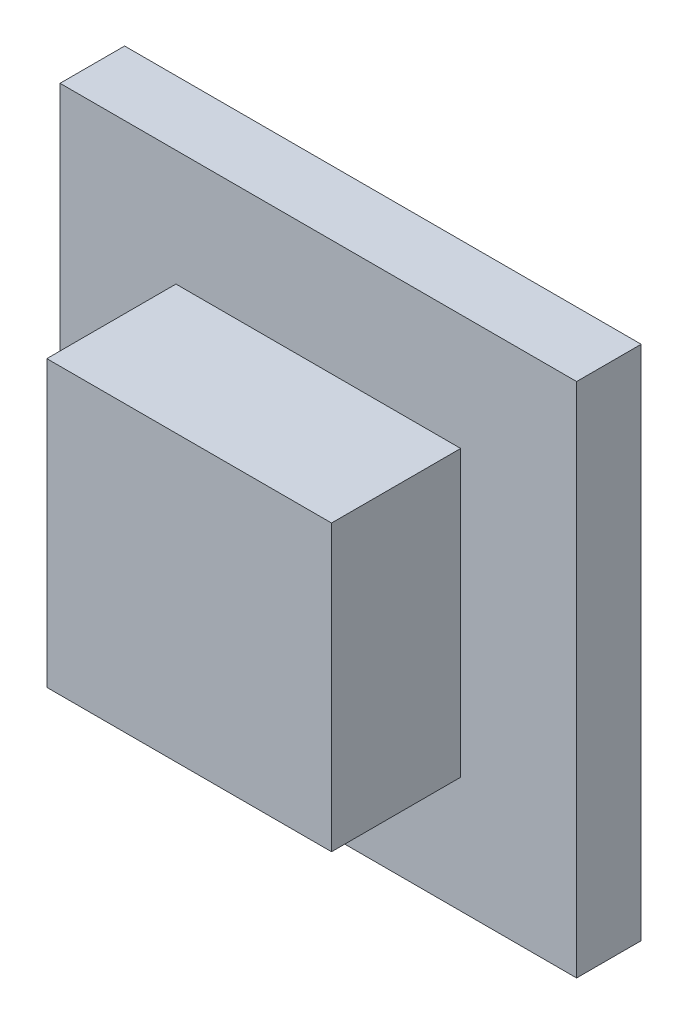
ISO-10303-21;
HEADER;
FILE_DESCRIPTION(('STEP AP214'),'2;1');
FILE_NAME('part.step','',(''),(''),'','','');
FILE_SCHEMA(('AUTOMOTIVE_DESIGN { 1 0 10303 214 1 1 1 1 }'));
ENDSEC;
DATA;
#1=APPLICATION_CONTEXT('core data for automotive mechanical design processes');
#2=APPLICATION_PROTOCOL_DEFINITION('international standard','automotive_design',2000,#1);
#3=PRODUCT_CONTEXT('',#1,'mechanical');
#4=PRODUCT('Part','Part','',(#3));
#5=PRODUCT_RELATED_PRODUCT_CATEGORY('part','',(#4));
#6=PRODUCT_DEFINITION_FORMATION('','',#4);
#7=PRODUCT_DEFINITION_CONTEXT('part definition',#1,'design');
#8=PRODUCT_DEFINITION('design','',#6,#7);
#9=PRODUCT_DEFINITION_SHAPE('','',#8);
#10=(LENGTH_UNIT() NAMED_UNIT(*) SI_UNIT(.MILLI.,.METRE.));
#11=(NAMED_UNIT(*) PLANE_ANGLE_UNIT() SI_UNIT($,.RADIAN.));
#12=(NAMED_UNIT(*) SI_UNIT($,.STERADIAN.) SOLID_ANGLE_UNIT());
#13=UNCERTAINTY_MEASURE_WITH_UNIT(LENGTH_MEASURE(1.E-05),#10,'distance_accuracy_value','');
#14=(GEOMETRIC_REPRESENTATION_CONTEXT(3) GLOBAL_UNCERTAINTY_ASSIGNED_CONTEXT((#13)) GLOBAL_UNIT_ASSIGNED_CONTEXT((#10,
#11,#12)) REPRESENTATION_CONTEXT('',''));
#15=CARTESIAN_POINT('',(0.,0.,0.));
#16=DIRECTION('',(0.,0.,1.));
#17=DIRECTION('',(1.,0.,0.));
#18=AXIS2_PLACEMENT_3D('',#15,#16,#17);
#19=CARTESIAN_POINT('',(0.,0.,0.));
#20=DIRECTION('',(0.,0.,1.));
#21=DIRECTION('',(1.,0.,0.));
#22=AXIS2_PLACEMENT_3D('',#19,#20,#21);
#23=PLANE('',#22);
#24=DIRECTION('',(0.,-1.,0.));
#25=VECTOR('',#24,1.);
#26=CARTESIAN_POINT('',(-3.175,-3.175,0.));
#27=LINE('',#26,#25);
#28=CARTESIAN_POINT('',(-3.175,3.175,0.));
#29=VERTEX_POINT('',#28);
#30=CARTESIAN_POINT('',(-3.175,-3.175,0.));
#31=VERTEX_POINT('',#30);
#32=EDGE_CURVE('E132',#29,#31,#27,.T.);
#33=ORIENTED_EDGE('',*,*,#32,.T.);
#34=DIRECTION('',(1.,0.,0.));
#35=VECTOR('',#34,1.);
#36=CARTESIAN_POINT('',(3.175,-3.175,0.));
#37=LINE('',#36,#35);
#38=CARTESIAN_POINT('',(3.175,-3.175,0.));
#39=VERTEX_POINT('',#38);
#40=EDGE_CURVE('E135',#31,#39,#37,.T.);
#41=ORIENTED_EDGE('',*,*,#40,.T.);
#42=DIRECTION('',(0.,1.,0.));
#43=VECTOR('',#42,1.);
#44=CARTESIAN_POINT('',(3.175,-3.175,0.));
#45=LINE('',#44,#43);
#46=CARTESIAN_POINT('',(3.175,3.175,0.));
#47=VERTEX_POINT('',#46);
#48=EDGE_CURVE('E152',#39,#47,#45,.T.);
#49=ORIENTED_EDGE('',*,*,#48,.T.);
#50=DIRECTION('',(-1.,0.,0.));
#51=VECTOR('',#50,1.);
#52=CARTESIAN_POINT('',(3.175,3.175,0.));
#53=LINE('',#52,#51);
#54=EDGE_CURVE('E143',#47,#29,#53,.T.);
#55=ORIENTED_EDGE('',*,*,#54,.T.);
#56=EDGE_LOOP('',(#33,#41,#49,#55));
#57=FACE_BOUND('',#56,.T.);
#58=DIRECTION('',(-1.,0.,0.));
#59=VECTOR('',#58,1.);
#60=CARTESIAN_POINT('',(-1.75,1.75,0.));
#61=LINE('',#60,#59);
#62=CARTESIAN_POINT('',(1.75,1.75,0.));
#63=VERTEX_POINT('',#62);
#64=CARTESIAN_POINT('',(-1.75,1.75,0.));
#65=VERTEX_POINT('',#64);
#66=EDGE_CURVE('E252',#63,#65,#61,.T.);
#67=ORIENTED_EDGE('',*,*,#66,.F.);
#68=DIRECTION('',(0.,1.,0.));
#69=VECTOR('',#68,1.);
#70=CARTESIAN_POINT('',(1.75,-1.75,0.));
#71=LINE('',#70,#69);
#72=CARTESIAN_POINT('',(1.75,-1.75,0.));
#73=VERTEX_POINT('',#72);
#74=EDGE_CURVE('E130',#73,#63,#71,.T.);
#75=ORIENTED_EDGE('',*,*,#74,.F.);
#76=DIRECTION('',(1.,0.,0.));
#77=VECTOR('',#76,1.);
#78=CARTESIAN_POINT('',(-1.75,-1.75,0.));
#79=LINE('',#78,#77);
#80=CARTESIAN_POINT('',(-1.75,-1.75,0.));
#81=VERTEX_POINT('',#80);
#82=EDGE_CURVE('E126',#81,#73,#79,.T.);
#83=ORIENTED_EDGE('',*,*,#82,.F.);
#84=DIRECTION('',(0.,-1.,0.));
#85=VECTOR('',#84,1.);
#86=CARTESIAN_POINT('',(-1.75,-1.75,0.));
#87=LINE('',#86,#85);
#88=EDGE_CURVE('E249',#65,#81,#87,.T.);
#89=ORIENTED_EDGE('',*,*,#88,.F.);
#90=EDGE_LOOP('',(#67,#75,#83,#89));
#91=FACE_BOUND('',#90,.T.);
#92=ADVANCED_FACE('F34',(#57,#91),#23,.T.);
#93=CARTESIAN_POINT('',(-3.175,-3.175,-0.79375));
#94=DIRECTION('',(-1.,0.,0.));
#95=DIRECTION('',(0.,0.,1.));
#96=AXIS2_PLACEMENT_3D('',#93,#94,#95);
#97=PLANE('',#96);
#98=ORIENTED_EDGE('',*,*,#32,.F.);
#99=DIRECTION('',(0.,0.,1.));
#100=VECTOR('',#99,1.);
#101=CARTESIAN_POINT('',(-3.175,3.175,-0.79375));
#102=LINE('',#101,#100);
#103=CARTESIAN_POINT('',(-3.175,3.175,-0.79375));
#104=VERTEX_POINT('',#103);
#105=EDGE_CURVE('E11',#104,#29,#102,.T.);
#106=ORIENTED_EDGE('',*,*,#105,.F.);
#107=DIRECTION('',(0.,-1.,0.));
#108=VECTOR('',#107,1.);
#109=CARTESIAN_POINT('',(-3.175,-3.175,-0.79375));
#110=LINE('',#109,#108);
#111=CARTESIAN_POINT('',(-3.175,-3.175,-0.79375));
#112=VERTEX_POINT('',#111);
#113=EDGE_CURVE('E140',#104,#112,#110,.T.);
#114=ORIENTED_EDGE('',*,*,#113,.T.);
#115=DIRECTION('',(0.,0.,1.));
#116=VECTOR('',#115,1.);
#117=CARTESIAN_POINT('',(-3.175,-3.175,-0.79375));
#118=LINE('',#117,#116);
#119=EDGE_CURVE('E38',#112,#31,#118,.T.);
#120=ORIENTED_EDGE('',*,*,#119,.T.);
#121=EDGE_LOOP('',(#98,#106,#114,#120));
#122=FACE_BOUND('',#121,.T.);
#123=ADVANCED_FACE('F36',(#122),#97,.T.);
#124=CARTESIAN_POINT('',(3.175,3.175,-0.79375));
#125=DIRECTION('',(0.,1.,0.));
#126=DIRECTION('',(-1.,0.,0.));
#127=AXIS2_PLACEMENT_3D('',#124,#125,#126);
#128=PLANE('',#127);
#129=ORIENTED_EDGE('',*,*,#54,.F.);
#130=DIRECTION('',(0.,0.,1.));
#131=VECTOR('',#130,1.);
#132=CARTESIAN_POINT('',(3.175,3.175,-0.79375));
#133=LINE('',#132,#131);
#134=CARTESIAN_POINT('',(3.175,3.175,-0.79375));
#135=VERTEX_POINT('',#134);
#136=EDGE_CURVE('E43',#135,#47,#133,.T.);
#137=ORIENTED_EDGE('',*,*,#136,.F.);
#138=DIRECTION('',(-1.,0.,0.));
#139=VECTOR('',#138,1.);
#140=CARTESIAN_POINT('',(3.175,3.175,-0.79375));
#141=LINE('',#140,#139);
#142=EDGE_CURVE('E148',#135,#104,#141,.T.);
#143=ORIENTED_EDGE('',*,*,#142,.T.);
#144=ORIENTED_EDGE('',*,*,#105,.T.);
#145=EDGE_LOOP('',(#129,#137,#143,#144));
#146=FACE_BOUND('',#145,.T.);
#147=ADVANCED_FACE('F162',(#146),#128,.T.);
#148=CARTESIAN_POINT('',(3.175,-3.175,-0.79375));
#149=DIRECTION('',(1.,0.,0.));
#150=DIRECTION('',(0.,0.,-1.));
#151=AXIS2_PLACEMENT_3D('',#148,#149,#150);
#152=PLANE('',#151);
#153=ORIENTED_EDGE('',*,*,#48,.F.);
#154=DIRECTION('',(0.,0.,1.));
#155=VECTOR('',#154,1.);
#156=CARTESIAN_POINT('',(3.175,-3.175,-0.79375));
#157=LINE('',#156,#155);
#158=CARTESIAN_POINT('',(3.175,-3.175,-0.79375));
#159=VERTEX_POINT('',#158);
#160=EDGE_CURVE('E157',#159,#39,#157,.T.);
#161=ORIENTED_EDGE('',*,*,#160,.F.);
#162=DIRECTION('',(0.,1.,0.));
#163=VECTOR('',#162,1.);
#164=CARTESIAN_POINT('',(3.175,-3.175,-0.79375));
#165=LINE('',#164,#163);
#166=EDGE_CURVE('E145',#159,#135,#165,.T.);
#167=ORIENTED_EDGE('',*,*,#166,.T.);
#168=ORIENTED_EDGE('',*,*,#136,.T.);
#169=EDGE_LOOP('',(#153,#161,#167,#168));
#170=FACE_BOUND('',#169,.T.);
#171=ADVANCED_FACE('F166',(#170),#152,.T.);
#172=CARTESIAN_POINT('',(3.175,-3.175,-0.79375));
#173=DIRECTION('',(0.,-1.,0.));
#174=DIRECTION('',(1.,0.,0.));
#175=AXIS2_PLACEMENT_3D('',#172,#173,#174);
#176=PLANE('',#175);
#177=ORIENTED_EDGE('',*,*,#40,.F.);
#178=ORIENTED_EDGE('',*,*,#119,.F.);
#179=DIRECTION('',(1.,0.,0.));
#180=VECTOR('',#179,1.);
#181=CARTESIAN_POINT('',(3.175,-3.175,-0.79375));
#182=LINE('',#181,#180);
#183=EDGE_CURVE('E142',#112,#159,#182,.T.);
#184=ORIENTED_EDGE('',*,*,#183,.T.);
#185=ORIENTED_EDGE('',*,*,#160,.T.);
#186=EDGE_LOOP('',(#177,#178,#184,#185));
#187=FACE_BOUND('',#186,.T.);
#188=ADVANCED_FACE('F159',(#187),#176,.T.);
#189=CARTESIAN_POINT('',(0.,0.,-0.79375));
#190=DIRECTION('',(0.,0.,1.));
#191=DIRECTION('',(1.,0.,0.));
#192=AXIS2_PLACEMENT_3D('',#189,#190,#191);
#193=PLANE('',#192);
#194=ORIENTED_EDGE('',*,*,#113,.F.);
#195=ORIENTED_EDGE('',*,*,#142,.F.);
#196=ORIENTED_EDGE('',*,*,#166,.F.);
#197=ORIENTED_EDGE('',*,*,#183,.F.);
#198=EDGE_LOOP('',(#194,#195,#196,#197));
#199=FACE_BOUND('',#198,.T.);
#200=ADVANCED_FACE('F168',(#199),#193,.F.);
#201=CARTESIAN_POINT('',(1.75,-1.75,1.5875));
#202=DIRECTION('',(-1.,0.,0.));
#203=DIRECTION('',(0.,0.,1.));
#204=AXIS2_PLACEMENT_3D('',#201,#202,#203);
#205=PLANE('',#204);
#206=ORIENTED_EDGE('',*,*,#74,.T.);
#207=DIRECTION('',(0.,0.,-1.));
#208=VECTOR('',#207,1.);
#209=CARTESIAN_POINT('',(1.75,1.75,1.5875));
#210=LINE('',#209,#208);
#211=CARTESIAN_POINT('',(1.75,1.75,1.5875));
#212=VERTEX_POINT('',#211);
#213=EDGE_CURVE('E111',#212,#63,#210,.T.);
#214=ORIENTED_EDGE('',*,*,#213,.F.);
#215=DIRECTION('',(0.,1.,0.));
#216=VECTOR('',#215,1.);
#217=CARTESIAN_POINT('',(1.75,-1.75,1.5875));
#218=LINE('',#217,#216);
#219=CARTESIAN_POINT('',(1.75,-1.75,1.5875));
#220=VERTEX_POINT('',#219);
#221=EDGE_CURVE('E118',#220,#212,#218,.T.);
#222=ORIENTED_EDGE('',*,*,#221,.F.);
#223=DIRECTION('',(0.,0.,-1.));
#224=VECTOR('',#223,1.);
#225=CARTESIAN_POINT('',(1.75,-1.75,1.5875));
#226=LINE('',#225,#224);
#227=EDGE_CURVE('E247',#220,#73,#226,.T.);
#228=ORIENTED_EDGE('',*,*,#227,.T.);
#229=EDGE_LOOP('',(#206,#214,#222,#228));
#230=FACE_BOUND('',#229,.T.);
#231=ADVANCED_FACE('F128',(#230),#205,.F.);
#232=CARTESIAN_POINT('',(-1.75,1.75,1.5875));
#233=DIRECTION('',(0.,-1.,0.));
#234=DIRECTION('',(0.,0.,-1.));
#235=AXIS2_PLACEMENT_3D('',#232,#233,#234);
#236=PLANE('',#235);
#237=ORIENTED_EDGE('',*,*,#66,.T.);
#238=DIRECTION('',(0.,0.,-1.));
#239=VECTOR('',#238,1.);
#240=CARTESIAN_POINT('',(-1.75,1.75,1.5875));
#241=LINE('',#240,#239);
#242=CARTESIAN_POINT('',(-1.75,1.75,1.5875));
#243=VERTEX_POINT('',#242);
#244=EDGE_CURVE('E114',#243,#65,#241,.T.);
#245=ORIENTED_EDGE('',*,*,#244,.F.);
#246=DIRECTION('',(-1.,0.,0.));
#247=VECTOR('',#246,1.);
#248=CARTESIAN_POINT('',(-1.75,1.75,1.5875));
#249=LINE('',#248,#247);
#250=EDGE_CURVE('E107',#212,#243,#249,.T.);
#251=ORIENTED_EDGE('',*,*,#250,.F.);
#252=ORIENTED_EDGE('',*,*,#213,.T.);
#253=EDGE_LOOP('',(#237,#245,#251,#252));
#254=FACE_BOUND('',#253,.T.);
#255=ADVANCED_FACE('F109',(#254),#236,.F.);
#256=CARTESIAN_POINT('',(-1.75,-1.75,1.5875));
#257=DIRECTION('',(1.,0.,0.));
#258=DIRECTION('',(0.,0.,-1.));
#259=AXIS2_PLACEMENT_3D('',#256,#257,#258);
#260=PLANE('',#259);
#261=ORIENTED_EDGE('',*,*,#88,.T.);
#262=DIRECTION('',(0.,0.,-1.));
#263=VECTOR('',#262,1.);
#264=CARTESIAN_POINT('',(-1.75,-1.75,1.5875));
#265=LINE('',#264,#263);
#266=CARTESIAN_POINT('',(-1.75,-1.75,1.5875));
#267=VERTEX_POINT('',#266);
#268=EDGE_CURVE('E51',#267,#81,#265,.T.);
#269=ORIENTED_EDGE('',*,*,#268,.F.);
#270=DIRECTION('',(0.,-1.,0.));
#271=VECTOR('',#270,1.);
#272=CARTESIAN_POINT('',(-1.75,-1.75,1.5875));
#273=LINE('',#272,#271);
#274=EDGE_CURVE('E117',#243,#267,#273,.T.);
#275=ORIENTED_EDGE('',*,*,#274,.F.);
#276=ORIENTED_EDGE('',*,*,#244,.T.);
#277=EDGE_LOOP('',(#261,#269,#275,#276));
#278=FACE_BOUND('',#277,.T.);
#279=ADVANCED_FACE('F216',(#278),#260,.F.);
#280=CARTESIAN_POINT('',(-1.75,-1.75,1.5875));
#281=DIRECTION('',(0.,1.,0.));
#282=DIRECTION('',(0.,0.,1.));
#283=AXIS2_PLACEMENT_3D('',#280,#281,#282);
#284=PLANE('',#283);
#285=ORIENTED_EDGE('',*,*,#82,.T.);
#286=ORIENTED_EDGE('',*,*,#227,.F.);
#287=DIRECTION('',(1.,0.,0.));
#288=VECTOR('',#287,1.);
#289=CARTESIAN_POINT('',(-1.75,-1.75,1.5875));
#290=LINE('',#289,#288);
#291=EDGE_CURVE('E122',#267,#220,#290,.T.);
#292=ORIENTED_EDGE('',*,*,#291,.F.);
#293=ORIENTED_EDGE('',*,*,#268,.T.);
#294=EDGE_LOOP('',(#285,#286,#292,#293));
#295=FACE_BOUND('',#294,.T.);
#296=ADVANCED_FACE('F225',(#295),#284,.F.);
#297=CARTESIAN_POINT('',(0.,0.,1.5875));
#298=DIRECTION('',(0.,0.,-1.));
#299=DIRECTION('',(-1.,0.,0.));
#300=AXIS2_PLACEMENT_3D('',#297,#298,#299);
#301=PLANE('',#300);
#302=ORIENTED_EDGE('',*,*,#221,.T.);
#303=ORIENTED_EDGE('',*,*,#250,.T.);
#304=ORIENTED_EDGE('',*,*,#274,.T.);
#305=ORIENTED_EDGE('',*,*,#291,.T.);
#306=EDGE_LOOP('',(#302,#303,#304,#305));
#307=FACE_BOUND('',#306,.T.);
#308=ADVANCED_FACE('F121',(#307),#301,.F.);
#309=CLOSED_SHELL('',(#92,#123,#147,#171,#188,#200,#231,#255,#279,#296,#308));
#310=MANIFOLD_SOLID_BREP('B2',#309);
#311=ADVANCED_BREP_SHAPE_REPRESENTATION('',(#18,#310),#14);
#312=SHAPE_DEFINITION_REPRESENTATION(#9,#311);
ENDSEC;
END-ISO-10303-21;
